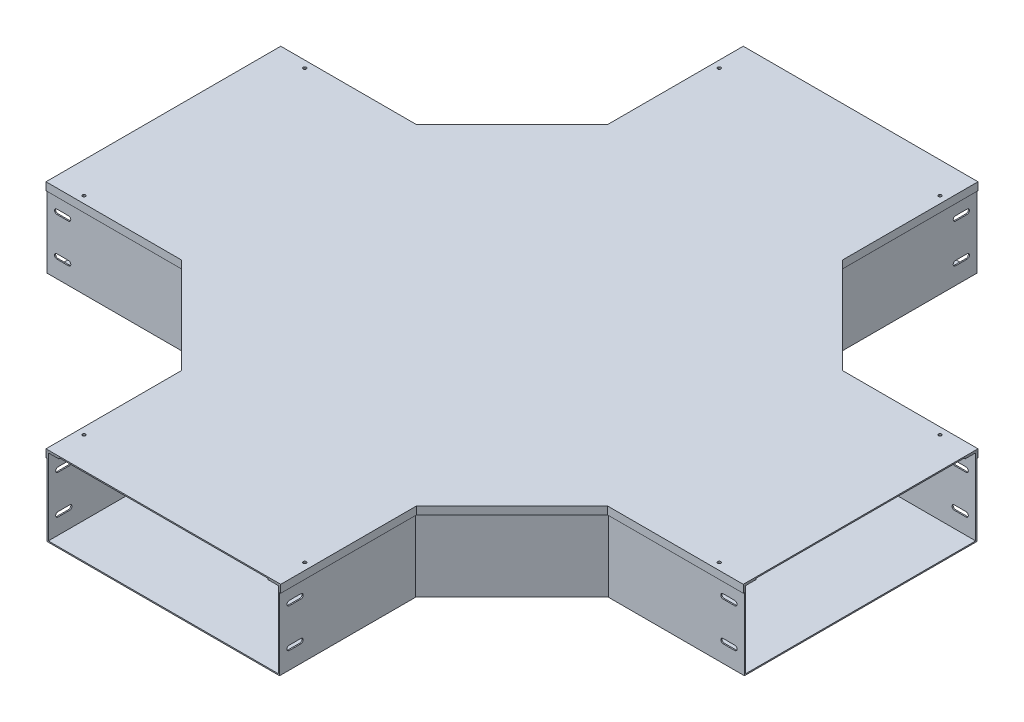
from build123d import *

# Parameters (mm, degrees)
BOSS_EXTRUDE1_DEPTH     = 1.5
EXTRUDE_THIN1_DEPTH     = 100
CUT_EXTRUDE1_DEPTH      = 639.35726674
CUT_EXTRUDE1_DEPTH_BACK = 639.35726674
CUT_EXTRUDE2_DEPTH      = 639.35726674
CUT_EXTRUDE2_DEPTH_BACK = 639.35726674
BOSS_EXTRUDE2_DEPTH     = 1.5
CUT_EXTRUDE3_REACH      = 646.439
SKETCH6_R               = 2
BOSS_EXTRUDE3_DEPTH     = 1.5
EXTRUDE_THIN2_DEPTH     = 10
SKETCH9_R               = 2
CUT_EXTRUDE4_DEPTH      = 1.5


with BuildPart() as part:
    # Sketch1 → Boss-Extrude1 (new body)
    with BuildSketch(Plane(origin=(0, -50, 0), x_dir=(1, 0, 0), z_dir=(0, 1, 0))):
        Polygon((-150, 450), (150, 450), (150, 274.264068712), (274.264068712, 150), (450, 150), (450, -150), (274.264068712, -150), (150, -274.264068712), (150, -450), (-150, -450), (-150, -274.264068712), (-274.264068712, -150), (-450, -150), (-450, 150), (-274.264068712, 150), (-150, 274.264068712), align=None)
    extrude(amount=BOSS_EXTRUDE1_DEPTH)

    # Sketch2 → Extrude-Thin1 (add)
    with BuildSketch(Plane(origin=(0, -50, 0), x_dir=(-1, 0, 0), z_dir=(0, -1, 0))):
        Polygon((-150, -450), (-150, -274.264068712), (-274.264068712, -150), (-450, -150), (-450, -148.5), (-273.642748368, -148.5), (-148.5, -273.642748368), (-148.5, -450), align=None)
        Polygon((-450, 150), (-274.264068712, 150), (-150, 274.264068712), (-150, 450), (-148.5, 450), (-148.5, 273.642748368), (-273.642748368, 148.5), (-450, 148.5), align=None)
        Polygon((150, 450), (150, 274.264068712), (274.264068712, 150), (450, 150), (450, 148.5), (273.642748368, 148.5), (148.5, 273.642748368), (148.5, 450), align=None)
        Polygon((450, -150), (274.264068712, -150), (150, -274.264068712), (150, -450), (148.5, -450), (148.5, -273.642748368), (273.642748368, -148.5), (450, -148.5), align=None)
    extrude(amount=-EXTRUDE_THIN1_DEPTH)

    # Sketch3 → Cut-Extrude1 (cut, two sides: drawn at the far end of the back side and taken through both)
    with BuildSketch(Plane.XY.offset(-CUT_EXTRUDE1_DEPTH_BACK)):
        with BuildLine():
            Line((422.5, 28), (437.5, 28))
            ThreePointArc((437.5, 28), (440.5, 25), (437.5, 22))
            Line((437.5, 22), (422.5, 22))
            ThreePointArc((422.5, 22), (419.5, 25), (422.5, 28))
        make_face()
        with BuildLine():
            Line((422.5, -22), (437.5, -22))
            ThreePointArc((437.5, -22), (440.5, -25), (437.5, -28))
            Line((437.5, -28), (422.5, -28))
            ThreePointArc((422.5, -28), (419.5, -25), (422.5, -22))
        make_face()
        with BuildLine():
            Line((-437.5, 28), (-422.5, 28))
            ThreePointArc((-422.5, 28), (-419.5, 25), (-422.5, 22))
            Line((-422.5, 22), (-437.5, 22))
            ThreePointArc((-437.5, 22), (-440.5, 25), (-437.5, 28))
        make_face()
        with BuildLine():
            Line((-437.5, -22), (-422.5, -22))
            ThreePointArc((-422.5, -22), (-419.5, -25), (-422.5, -28))
            Line((-422.5, -28), (-437.5, -28))
            ThreePointArc((-437.5, -28), (-440.5, -25), (-437.5, -22))
        make_face()
    extrude(amount=CUT_EXTRUDE1_DEPTH + CUT_EXTRUDE1_DEPTH_BACK, mode=Mode.SUBTRACT)

    # Sketch4 → Cut-Extrude2 (cut, two sides: drawn at the far end of the back side and taken through both)
    with BuildSketch(Plane(origin=(0, 0, 0), x_dir=(0, 0, -1), z_dir=(1, 0, 0)).offset(-CUT_EXTRUDE2_DEPTH_BACK)):
        with BuildLine():
            Line((-437.5, 28), (-422.5, 28))
            ThreePointArc((-422.5, 28), (-419.5, 25), (-422.5, 22))
            Line((-422.5, 22), (-437.5, 22))
            ThreePointArc((-437.5, 22), (-440.5, 25), (-437.5, 28))
        make_face()
        with BuildLine():
            Line((-437.5, -22), (-422.5, -22))
            ThreePointArc((-422.5, -22), (-419.5, -25), (-422.5, -28))
            Line((-422.5, -28), (-437.5, -28))
            ThreePointArc((-437.5, -28), (-440.5, -25), (-437.5, -22))
        make_face()
        with BuildLine():
            Line((422.5, 28), (437.5, 28))
            ThreePointArc((437.5, 28), (440.5, 25), (437.5, 22))
            Line((437.5, 22), (422.5, 22))
            ThreePointArc((422.5, 22), (419.5, 25), (422.5, 28))
        make_face()
        with BuildLine():
            Line((422.5, -22), (437.5, -22))
            ThreePointArc((437.5, -22), (440.5, -25), (437.5, -28))
            Line((437.5, -28), (422.5, -28))
            ThreePointArc((422.5, -28), (419.5, -25), (422.5, -22))
        make_face()
    extrude(amount=CUT_EXTRUDE2_DEPTH + CUT_EXTRUDE2_DEPTH_BACK, mode=Mode.SUBTRACT)

    # Sketch5 → Boss-Extrude2 (add)
    with BuildSketch(Plane(origin=(0, 50, 0), x_dir=(1, 0, 0), z_dir=(0, 1, 0))):
        Polygon((450, 135), (268.050865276, 135), (135, 268.050865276), (135, 450), (150, 450), (150, 274.264068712), (274.264068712, 150), (450, 150), align=None)
        Polygon((-135, 450), (-135, 268.050865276), (-268.050865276, 135), (-450, 135), (-450, 150), (-274.264068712, 150), (-150, 274.264068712), (-150, 450), align=None)
        Polygon((-450, -135), (-268.050865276, -135), (-135, -268.050865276), (-135, -450), (-150, -450), (-150, -274.264068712), (-274.264068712, -150), (-450, -150), align=None)
        Polygon((135, -450), (135, -268.050865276), (268.050865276, -135), (450, -135), (450, -150), (274.264068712, -150), (150, -274.264068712), (150, -450), align=None)
    extrude(amount=BOSS_EXTRUDE2_DEPTH)

    # Sketch6 → Cut-Extrude3 (cut, up to next)
    with BuildSketch(Plane(origin=(0, 51.5, 0), x_dir=(1, 0, 0), z_dir=(0, 1, 0)), mode=Mode.PRIVATE) as cut_extrude3_sk1:
        with Locations(Location((-410, -142.5, 0), (0, 0, 270))):
            Circle(SKETCH6_R)
    cut_extrude3_tool1 = extrude(cut_extrude3_sk1.sketch, amount=-CUT_EXTRUDE3_REACH, mode=Mode.PRIVATE) & part.part
    # Sketch6 → Cut-Extrude3 (cut, up to next)
    with BuildSketch(Plane(origin=(0, 51.5, 0), x_dir=(1, 0, 0), z_dir=(0, 1, 0)), mode=Mode.PRIVATE) as cut_extrude3_sk2:
        with Locations(Location((-410, 142.5, 0), (0, 0, 270))):
            Circle(SKETCH6_R)
    cut_extrude3_tool2 = extrude(cut_extrude3_sk2.sketch, amount=-CUT_EXTRUDE3_REACH, mode=Mode.PRIVATE) & part.part
    # Sketch6 → Cut-Extrude3 (cut, up to next)
    with BuildSketch(Plane(origin=(0, 51.5, 0), x_dir=(1, 0, 0), z_dir=(0, 1, 0)), mode=Mode.PRIVATE) as cut_extrude3_sk3:
        with Locations(Location((-142.5, 410, 0), (0, 0, 270))):
            Circle(SKETCH6_R)
    cut_extrude3_tool3 = extrude(cut_extrude3_sk3.sketch, amount=-CUT_EXTRUDE3_REACH, mode=Mode.PRIVATE) & part.part
    # Sketch6 → Cut-Extrude3 (cut, up to next)
    with BuildSketch(Plane(origin=(0, 51.5, 0), x_dir=(1, 0, 0), z_dir=(0, 1, 0)), mode=Mode.PRIVATE) as cut_extrude3_sk4:
        with Locations(Location((142.5, 410, 0), (0, 0, 270))):
            Circle(SKETCH6_R)
    cut_extrude3_tool4 = extrude(cut_extrude3_sk4.sketch, amount=-CUT_EXTRUDE3_REACH, mode=Mode.PRIVATE) & part.part
    # Sketch6 → Cut-Extrude3 (cut, up to next)
    with BuildSketch(Plane(origin=(0, 51.5, 0), x_dir=(1, 0, 0), z_dir=(0, 1, 0)), mode=Mode.PRIVATE) as cut_extrude3_sk5:
        with Locations(Location((410, 142.5, 0), (0, 0, 270))):
            Circle(SKETCH6_R)
    cut_extrude3_tool5 = extrude(cut_extrude3_sk5.sketch, amount=-CUT_EXTRUDE3_REACH, mode=Mode.PRIVATE) & part.part
    # Sketch6 → Cut-Extrude3 (cut, up to next)
    with BuildSketch(Plane(origin=(0, 51.5, 0), x_dir=(1, 0, 0), z_dir=(0, 1, 0)), mode=Mode.PRIVATE) as cut_extrude3_sk6:
        with Locations(Location((410, -142.5, 0), (0, 0, 270))):
            Circle(SKETCH6_R)
    cut_extrude3_tool6 = extrude(cut_extrude3_sk6.sketch, amount=-CUT_EXTRUDE3_REACH, mode=Mode.PRIVATE) & part.part
    # Sketch6 → Cut-Extrude3 (cut, up to next)
    with BuildSketch(Plane(origin=(0, 51.5, 0), x_dir=(1, 0, 0), z_dir=(0, 1, 0)), mode=Mode.PRIVATE) as cut_extrude3_sk7:
        with Locations(Location((142.5, -410, 0), (0, 0, 270))):
            Circle(SKETCH6_R)
    cut_extrude3_tool7 = extrude(cut_extrude3_sk7.sketch, amount=-CUT_EXTRUDE3_REACH, mode=Mode.PRIVATE) & part.part
    # Sketch6 → Cut-Extrude3 (cut, up to next)
    with BuildSketch(Plane(origin=(0, 51.5, 0), x_dir=(1, 0, 0), z_dir=(0, 1, 0)), mode=Mode.PRIVATE) as cut_extrude3_sk8:
        with Locations(Location((-142.5, -410, 0), (0, 0, 270))):
            Circle(SKETCH6_R)
    cut_extrude3_tool8 = extrude(cut_extrude3_sk8.sketch, amount=-CUT_EXTRUDE3_REACH, mode=Mode.PRIVATE) & part.part
    add(cut_extrude3_tool1.solids().sort_by_distance((-410, 51.5, 142.5))[0], mode=Mode.SUBTRACT)
    add(cut_extrude3_tool2.solids().sort_by_distance((-410, 51.5, -142.5))[0], mode=Mode.SUBTRACT)
    add(cut_extrude3_tool3.solids().sort_by_distance((-142.5, 51.5, -410))[0], mode=Mode.SUBTRACT)
    add(cut_extrude3_tool4.solids().sort_by_distance((142.5, 51.5, -410))[0], mode=Mode.SUBTRACT)
    add(cut_extrude3_tool5.solids().sort_by_distance((410, 51.5, -142.5))[0], mode=Mode.SUBTRACT)
    add(cut_extrude3_tool6.solids().sort_by_distance((410, 51.5, 142.5))[0], mode=Mode.SUBTRACT)
    add(cut_extrude3_tool7.solids().sort_by_distance((142.5, 51.5, 410))[0], mode=Mode.SUBTRACT)
    add(cut_extrude3_tool8.solids().sort_by_distance((-142.5, 51.5, 410))[0], mode=Mode.SUBTRACT)


with BuildPart() as body_2:
    # Sketch7 → Boss-Extrude3 (new body)
    with BuildSketch(Plane(origin=(0, 51.5, 0), x_dir=(1, 0, 0), z_dir=(0, 1, 0))):
        Polygon((274.264068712, 150), (150, 274.264068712), (150, 450), (-150, 450), (-150, 274.264068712), (-274.264068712, 150), (-450, 150), (-450, -150), (-274.264068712, -150), (-150, -274.264068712), (-150, -450), (150, -450), (150, -274.264068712), (274.264068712, -150), (450, -150), (450, 150), align=None)
    extrude(amount=BOSS_EXTRUDE3_DEPTH)

    # Sketch8 → Extrude-Thin2 (add)
    with BuildSketch(Plane(origin=(0, 53, 0), x_dir=(1, 0, 0), z_dir=(0, 1, 0))):
        Polygon((450, 150), (274.264068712, 150), (150, 274.264068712), (150, 450), (151.5, 450), (151.5, 274.885389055), (274.885389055, 151.5), (450, 151.5), align=None)
        Polygon((150, -450), (150, -274.264068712), (274.264068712, -150), (450, -150), (450, -151.5), (274.885389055, -151.5), (151.5, -274.885389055), (151.5, -450), align=None)
        Polygon((-450, -150), (-274.264068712, -150), (-150, -274.264068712), (-150, -450), (-151.5, -450), (-151.5, -274.885389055), (-274.885389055, -151.5), (-450, -151.5), align=None)
        Polygon((-150, 450), (-150, 274.264068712), (-274.264068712, 150), (-450, 150), (-450, 151.5), (-274.885389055, 151.5), (-151.5, 274.885389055), (-151.5, 450), align=None)
    extrude(amount=-EXTRUDE_THIN2_DEPTH)

    # Sketch9 → Cut-Extrude4 (cut)
    with BuildSketch(Plane(origin=(0, 53, 0), x_dir=(1, 0, 0), z_dir=(0, 1, 0))):
        with Locations(Location((-142.5, -410, 0), (0, 0, 270))):
            Circle(SKETCH9_R)
        with Locations(Location((142.5, -410, 0), (0, 0, 270))):
            Circle(SKETCH9_R)
        with Locations(Location((410, -142.5, 0), (0, 0, 270))):
            Circle(SKETCH9_R)
        with Locations(Location((410, 142.5, 0), (0, 0, 270))):
            Circle(SKETCH9_R)
        with Locations(Location((142.5, 410, 0), (0, 0, 270))):
            Circle(SKETCH9_R)
        with Locations(Location((-142.5, 410, 0), (0, 0, 270))):
            Circle(SKETCH9_R)
        with Locations(Location((-410, 142.5, 0), (0, 0, 270))):
            Circle(SKETCH9_R)
        with Locations(Location((-410, -142.5, 0), (0, 0, 270))):
            Circle(SKETCH9_R)
    extrude(amount=-CUT_EXTRUDE4_DEPTH, mode=Mode.SUBTRACT)


solid = Compound([part.part, body_2.part])
